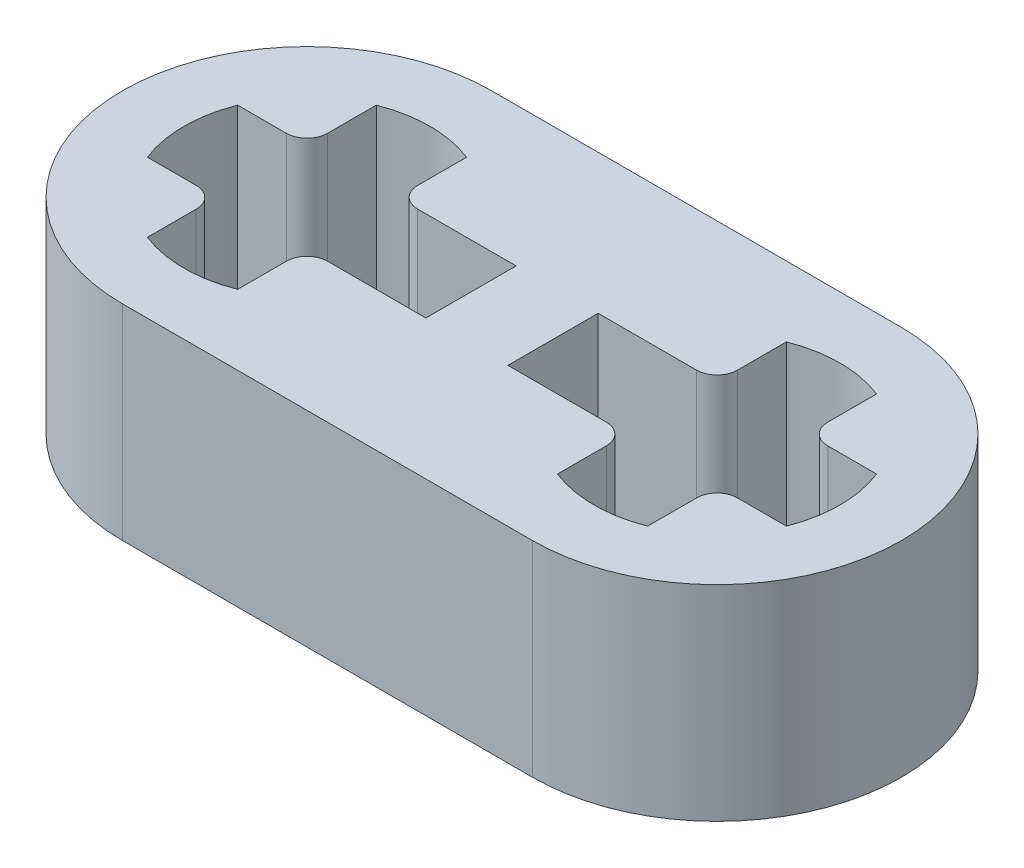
from build123d import *

# Parameters (mm, degrees)
BOSS_EXTRUDE1_DEPTH      = 2
BOSS_EXTRUDE1_DEPTH_BACK = 2


with BuildPart() as part:
    # Sketch2 → Boss-Extrude1 (new, two sides: drawn at the far end of the back side and taken through both)
    with BuildSketch(Plane(origin=(0, 0, 0), x_dir=(1, 0, 0), z_dir=(0, 1, 0)).offset(-BOSS_EXTRUDE1_DEPTH_BACK)):
        with BuildLine():
            Line((-4, 3.6), (4, 3.6))
            ThreePointArc((4, 3.6), (7.6, 0), (4, -3.6))
            Line((4, -3.6), (-4, -3.6))
            ThreePointArc((-4, -3.6), (-7.6, 0), (-4, 3.6))
        make_face()
        with BuildLine():
            Line((-4.88, 2.232845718), (-4.88, 1.28))
            ThreePointArc((-4.88, 1.28), (-4.997157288, 0.997157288), (-5.28, 0.88))
            Line((-5.28, 0.88), (-6.232845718, 0.88))
            ThreePointArc((-6.232845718, 0.88), (-6.4, 0), (-6.232845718, -0.88))
            Line((-6.232845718, -0.88), (-5.28, -0.88))
            ThreePointArc((-5.28, -0.88), (-4.997157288, -0.997157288), (-4.88, -1.28))
            Line((-4.88, -1.28), (-4.88, -2.232845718))
            ThreePointArc((-4.88, -2.232845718), (-4, -2.4), (-3.12, -2.232845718))
            Line((-3.12, -2.232845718), (-3.12, -1.28))
            ThreePointArc((-3.12, -1.28), (-3.002842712, -0.997157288), (-2.72, -0.88))
            Line((-2.72, -0.88), (-1.767154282, -0.88))
            Line((-1.767154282, -0.88), (-0.8, -0.88))
            Line((-0.8, -0.88), (-0.8, 0.88))
            Line((-0.8, 0.88), (-1.767154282, 0.88))
            Line((-1.767154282, 0.88), (-2.72, 0.88))
            ThreePointArc((-2.72, 0.88), (-3.002842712, 0.997157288), (-3.12, 1.28))
            Line((-3.12, 1.28), (-3.12, 2.232845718))
            ThreePointArc((-3.12, 2.232845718), (-4, 2.4), (-4.88, 2.232845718))
        make_face(mode=Mode.SUBTRACT)
        with BuildLine():
            Line((3.12, 2.232845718), (3.12, 1.28))
            ThreePointArc((3.12, 1.28), (3.002842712, 0.997157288), (2.72, 0.88))
            Line((2.72, 0.88), (1.767154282, 0.88))
            Line((1.767154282, 0.88), (0.8, 0.88))
            Line((0.8, 0.88), (0.8, -0.88))
            Line((0.8, -0.88), (1.767154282, -0.88))
            Line((1.767154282, -0.88), (2.72, -0.88))
            ThreePointArc((2.72, -0.88), (3.002842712, -0.997157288), (3.12, -1.28))
            Line((3.12, -1.28), (3.12, -2.232845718))
            ThreePointArc((3.12, -2.232845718), (4, -2.4), (4.88, -2.232845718))
            Line((4.88, -2.232845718), (4.88, -1.28))
            ThreePointArc((4.88, -1.28), (4.997157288, -0.997157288), (5.28, -0.88))
            Line((5.28, -0.88), (6.232845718, -0.88))
            ThreePointArc((6.232845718, -0.88), (6.4, 0), (6.232845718, 0.88))
            Line((6.232845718, 0.88), (5.28, 0.88))
            ThreePointArc((5.28, 0.88), (4.997157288, 0.997157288), (4.88, 1.28))
            Line((4.88, 1.28), (4.88, 2.232845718))
            ThreePointArc((4.88, 2.232845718), (4, 2.4), (3.12, 2.232845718))
        make_face(mode=Mode.SUBTRACT)
    extrude(amount=BOSS_EXTRUDE1_DEPTH + BOSS_EXTRUDE1_DEPTH_BACK)


solid = part.part
